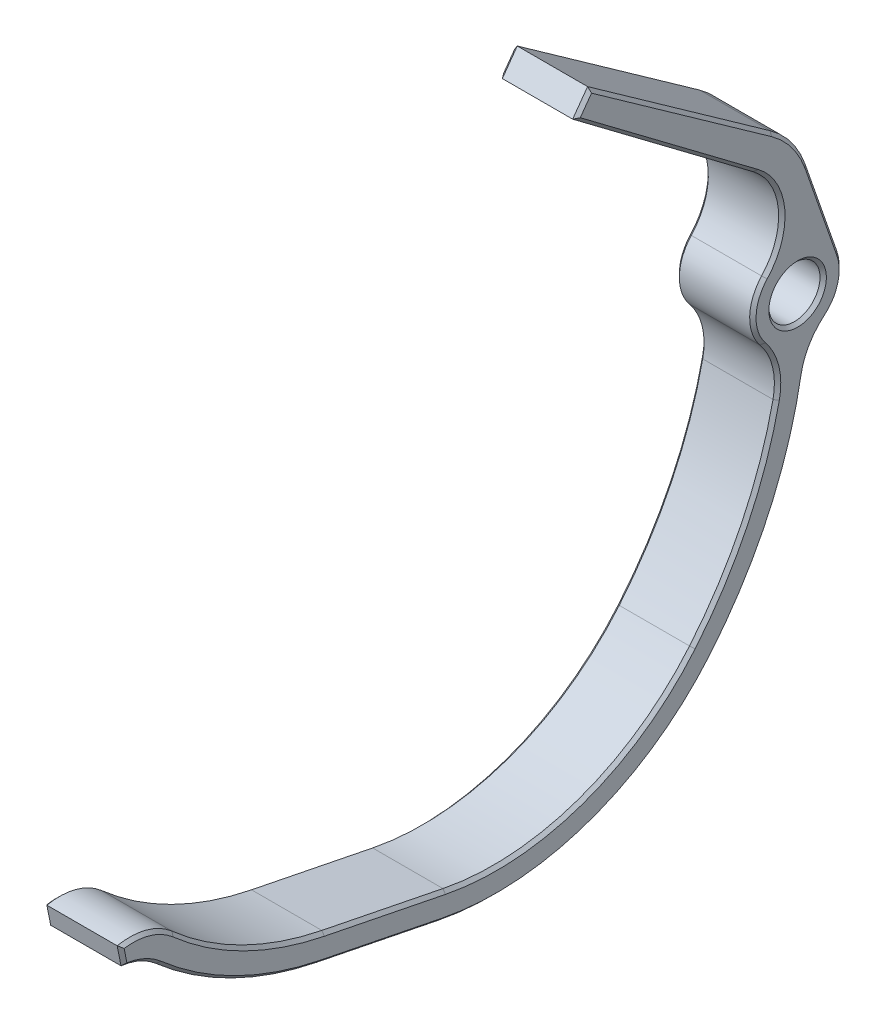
from build123d import *

# Parameters (mm, degrees)
SKETCH_1_R      = 2
EXTRUDE_1_DEPTH = 6
CHAMFER_1_SIZE  = 0.25


with BuildPart() as part:
    # Sketch 1 → Extrude 1 (new body)
    with BuildSketch(Plane(origin=(0, 0, 0), x_dir=(0, 0, -1), z_dir=(1, 0, 0))):
        with BuildLine():
            Line((-27.493969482, -26.658876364), (-36.97109375, -24.755822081))
            ThreePointArc((-36.97109375, -24.755822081), (-43.215678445, -22.62235746), (-48.694214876, -18.943750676))
            ThreePointArc((-48.694214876, -18.943750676), (-50.702188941, -17.866356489), (-52.979730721, -17.791915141))
            Line((-52.979730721, -17.791915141), (-52.677725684, -19.303302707))
            ThreePointArc((-52.677725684, -19.303302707), (-51.218034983, -19.697016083), (-49.942751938, -20.509026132))
            ThreePointArc((-49.942751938, -20.509026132), (-44.060047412, -24.435993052), (-37.36484375, -26.716679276))
            Line((-37.36484375, -26.716679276), (-27.887719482, -28.619733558))
            ThreePointArc((-27.887719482, -28.619733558), (-16.251819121, -27.802221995), (-6.669408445, -21.150913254))
            ThreePointArc((-6.669408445, -21.150913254), (-2.063501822, -13.885462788), (0.508120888, -5.676449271))
            ThreePointArc((0.508120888, -5.676449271), (1.107164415, -4.030123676), (2.237362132, -2.691507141))
            ThreePointArc((2.237362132, -2.691507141), (3.37197956, -0.937951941), (3.305810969, 1.149614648))
            Line((3.305810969, 1.149614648), (0.840819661, 8.237898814))
            ThreePointArc((0.840819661, 8.237898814), (-0.245380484, 10.276837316), (-1.901195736, 11.887854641))
            Line((-1.901195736, 11.887854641), (-16.180701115, 22.014883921))
            Line((-16.180701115, 22.014883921), (-17.347783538, 20.390716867))
            Line((-17.347783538, 20.390716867), (-3.229602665, 9.773416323))
            ThreePointArc((-3.229602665, 9.773416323), (-1.254730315, 6.223383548), (-2.567267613, 2.378894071))
            ThreePointArc((-2.567267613, 2.378894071), (-3.498459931, 0.103817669), (-2.703814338, -2.222473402))
            ThreePointArc((-2.703814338, -2.222473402), (-1.709054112, -4.211631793), (-1.675330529, -6.435403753))
            ThreePointArc((-1.675330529, -6.435403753), (-4.11880137, -13.551338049), (-8.204595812, -19.869039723))
            ThreePointArc((-8.204595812, -19.869039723), (-16.915878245, -25.915684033), (-27.493969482, -26.658876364))
        make_face()
        Circle(SKETCH_1_R, mode=Mode.SUBTRACT)
    extrude(amount=EXTRUDE_1_DEPTH)

    # Chamfer 1
    chamfer_1_edges = [part.edges().sort_by_distance(p)[0] for p in [
        (6, -24.435993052, 44.060047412),
        (6, -27.668206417, 32.626281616),
        (6, -27.802221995, 16.251819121),
        (0, 0, 2),
        (6, -13.885462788, 2.063501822),
        (0, -18.547608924, 52.828728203),
        (0, -17.866356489, 50.702188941),
        (0, -22.62235746, 43.215678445),
        (0, -25.707349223, 32.232531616),
        (0, -25.915684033, 16.915878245),
        (0, -13.551338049, 4.11880137),
        (0, -4.211631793, 1.709054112),
        (0, 0.103817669, 3.498459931),
        (6, -4.030123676, -1.107164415),
        (0, 6.223383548, 1.254730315),
        (0, 15.082066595, 10.288693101),
        (0, 21.202800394, 16.764242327),
        (0, 16.951369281, 9.040948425),
        (0, 10.276837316, 0.245380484),
        (0, 4.693756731, -2.073315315),
        (0, -0.937951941, -3.37197956),
        (0, -4.030123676, -1.107164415),
        (6, -0.937951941, -3.37197956),
        (0, -13.885462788, 2.063501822),
        (0, -27.802221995, 16.251819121),
        (0, -27.668206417, 32.626281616),
        (0, -24.435993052, 44.060047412),
        (0, -19.697016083, 51.218034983),
        (6, 4.693756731, -2.073315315),
        (6, 10.276837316, 0.245380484),
        (6, 16.951369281, 9.040948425),
        (6, 21.202800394, 16.764242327),
        (6, 15.082066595, 10.288693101),
        (6, 6.223383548, 1.254730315),
        (6, 0.103817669, 3.498459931),
        (6, -19.697016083, 51.218034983),
        (6, -4.211631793, 1.709054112),
        (6, -13.551338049, 4.11880137),
        (6, -25.915684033, 16.915878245),
        (6, -25.707349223, 32.232531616),
        (6, -22.62235746, 43.215678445),
        (6, -17.866356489, 50.702188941),
        (6, -18.547608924, 52.828728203),
        (6, 0, 2),
    ]]
    chamfer(chamfer_1_edges, length=CHAMFER_1_SIZE)


solid = part.part
